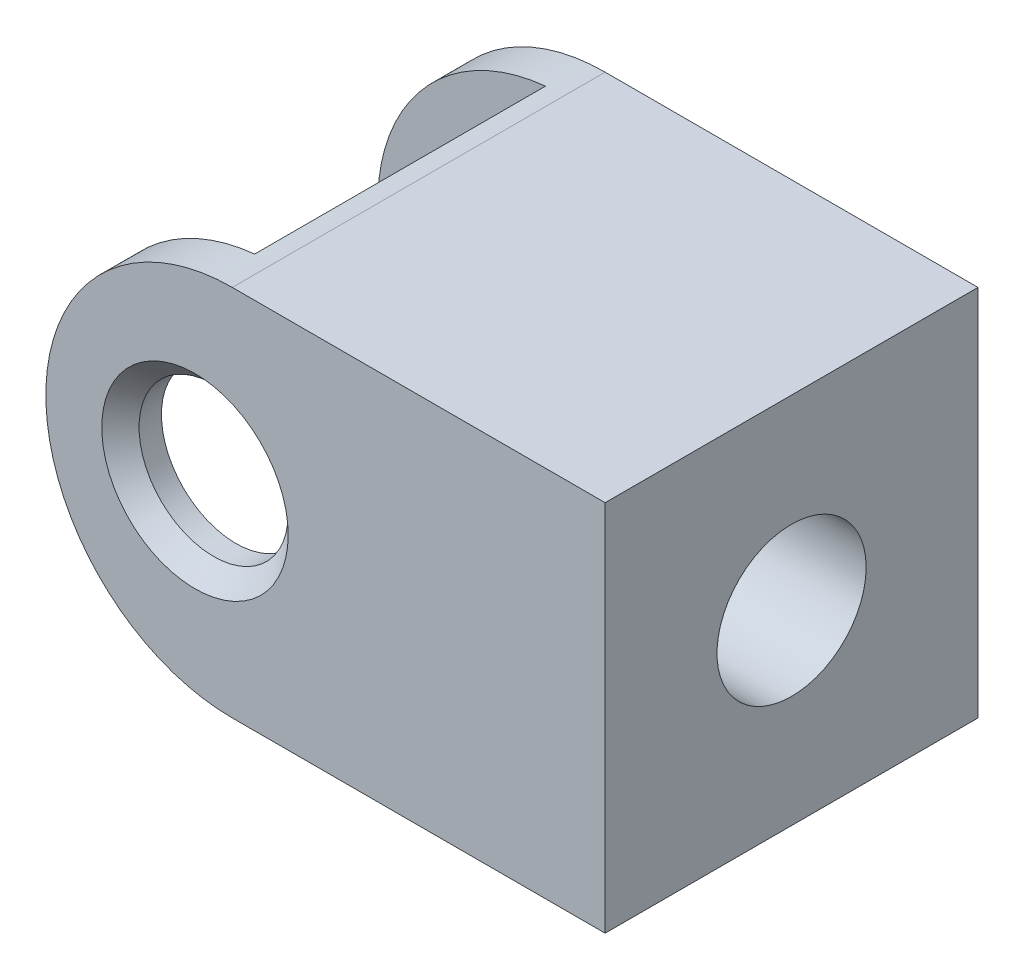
ISO-10303-21;
HEADER;
FILE_DESCRIPTION(('STEP AP214'),'2;1');
FILE_NAME('part.step','',(''),(''),'','','');
FILE_SCHEMA(('AUTOMOTIVE_DESIGN { 1 0 10303 214 1 1 1 1 }'));
ENDSEC;
DATA;
#1=APPLICATION_CONTEXT('core data for automotive mechanical design processes');
#2=APPLICATION_PROTOCOL_DEFINITION('international standard','automotive_design',2000,#1);
#3=PRODUCT_CONTEXT('',#1,'mechanical');
#4=PRODUCT('Part','Part','',(#3));
#5=PRODUCT_RELATED_PRODUCT_CATEGORY('part','',(#4));
#6=PRODUCT_DEFINITION_FORMATION('','',#4);
#7=PRODUCT_DEFINITION_CONTEXT('part definition',#1,'design');
#8=PRODUCT_DEFINITION('design','',#6,#7);
#9=PRODUCT_DEFINITION_SHAPE('','',#8);
#10=(LENGTH_UNIT() NAMED_UNIT(*) SI_UNIT(.MILLI.,.METRE.));
#11=(NAMED_UNIT(*) PLANE_ANGLE_UNIT() SI_UNIT($,.RADIAN.));
#12=(NAMED_UNIT(*) SI_UNIT($,.STERADIAN.) SOLID_ANGLE_UNIT());
#13=UNCERTAINTY_MEASURE_WITH_UNIT(LENGTH_MEASURE(1.E-05),#10,'distance_accuracy_value','');
#14=(GEOMETRIC_REPRESENTATION_CONTEXT(3) GLOBAL_UNCERTAINTY_ASSIGNED_CONTEXT((#13)) GLOBAL_UNIT_ASSIGNED_CONTEXT((#10,
#11,#12)) REPRESENTATION_CONTEXT('',''));
#15=CARTESIAN_POINT('',(0.,0.,0.));
#16=DIRECTION('',(0.,0.,1.));
#17=DIRECTION('',(1.,0.,0.));
#18=AXIS2_PLACEMENT_3D('',#15,#16,#17);
#19=CARTESIAN_POINT('',(0.,0.,20.));
#20=DIRECTION('',(0.,0.,-1.));
#21=DIRECTION('',(-1.,0.,0.));
#22=AXIS2_PLACEMENT_3D('',#19,#20,#21);
#23=CYLINDRICAL_SURFACE('',#22,10.);
#24=DIRECTION('',(0.,0.,-1.));
#25=VECTOR('',#24,1.);
#26=CARTESIAN_POINT('',(-0.999999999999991,9.9498743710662,10.));
#27=LINE('',#26,#25);
#28=CARTESIAN_POINT('',(-0.999999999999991,9.9498743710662,17.8));
#29=VERTEX_POINT('',#28);
#30=CARTESIAN_POINT('',(-0.999999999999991,9.9498743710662,2.2));
#31=VERTEX_POINT('',#30);
#32=EDGE_CURVE('E117',#29,#31,#27,.T.);
#33=ORIENTED_EDGE('',*,*,#32,.F.);
#34=CARTESIAN_POINT('',(0.,0.,17.8));
#35=DIRECTION('',(0.,0.,1.));
#36=DIRECTION('',(1.,0.,0.));
#37=AXIS2_PLACEMENT_3D('',#34,#35,#36);
#38=CIRCLE('',#37,10.);
#39=CARTESIAN_POINT('',(-0.999999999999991,-9.9498743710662,17.8));
#40=VERTEX_POINT('',#39);
#41=EDGE_CURVE('E123',#29,#40,#38,.T.);
#42=ORIENTED_EDGE('',*,*,#41,.T.);
#43=DIRECTION('',(0.,0.,-1.));
#44=VECTOR('',#43,1.);
#45=CARTESIAN_POINT('',(-0.999999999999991,-9.9498743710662,10.));
#46=LINE('',#45,#44);
#47=CARTESIAN_POINT('',(-0.999999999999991,-9.9498743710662,2.2));
#48=VERTEX_POINT('',#47);
#49=EDGE_CURVE('E110',#48,#40,#46,.F.);
#50=ORIENTED_EDGE('',*,*,#49,.F.);
#51=CARTESIAN_POINT('',(0.,0.,2.2));
#52=DIRECTION('',(0.,0.,1.));
#53=DIRECTION('',(1.,0.,0.));
#54=AXIS2_PLACEMENT_3D('',#51,#52,#53);
#55=CIRCLE('',#54,10.);
#56=EDGE_CURVE('E105',#31,#48,#55,.T.);
#57=ORIENTED_EDGE('',*,*,#56,.F.);
#58=EDGE_LOOP('',(#33,#42,#50,#57));
#59=FACE_BOUND('',#58,.T.);
#60=CARTESIAN_POINT('',(0.,0.,0.));
#61=DIRECTION('',(0.,0.,1.));
#62=DIRECTION('',(1.,0.,0.));
#63=AXIS2_PLACEMENT_3D('',#60,#61,#62);
#64=CIRCLE('',#63,10.);
#65=CARTESIAN_POINT('',(0.,10.,0.));
#66=VERTEX_POINT('',#65);
#67=CARTESIAN_POINT('',(0.,-10.,0.));
#68=VERTEX_POINT('',#67);
#69=EDGE_CURVE('E211',#66,#68,#64,.T.);
#70=ORIENTED_EDGE('',*,*,#69,.T.);
#71=DIRECTION('',(0.,0.,-1.));
#72=VECTOR('',#71,1.);
#73=CARTESIAN_POINT('',(0.,-10.,20.));
#74=LINE('',#73,#72);
#75=CARTESIAN_POINT('',(0.,-10.,20.));
#76=VERTEX_POINT('',#75);
#77=EDGE_CURVE('E111',#76,#68,#74,.T.);
#78=ORIENTED_EDGE('',*,*,#77,.F.);
#79=CARTESIAN_POINT('',(0.,0.,20.));
#80=DIRECTION('',(0.,0.,1.));
#81=DIRECTION('',(1.,0.,0.));
#82=AXIS2_PLACEMENT_3D('',#79,#80,#81);
#83=CIRCLE('',#82,10.);
#84=CARTESIAN_POINT('',(0.,10.,20.));
#85=VERTEX_POINT('',#84);
#86=EDGE_CURVE('E212',#85,#76,#83,.T.);
#87=ORIENTED_EDGE('',*,*,#86,.F.);
#88=DIRECTION('',(0.,0.,-1.));
#89=VECTOR('',#88,1.);
#90=CARTESIAN_POINT('',(0.,10.,20.));
#91=LINE('',#90,#89);
#92=EDGE_CURVE('E218',#85,#66,#91,.T.);
#93=ORIENTED_EDGE('',*,*,#92,.T.);
#94=EDGE_LOOP('',(#70,#78,#87,#93));
#95=FACE_BOUND('',#94,.T.);
#96=ADVANCED_FACE('F43',(#59,#95),#23,.T.);
#97=CARTESIAN_POINT('',(20.,-10.,20.));
#98=DIRECTION('',(0.,1.,0.));
#99=DIRECTION('',(0.,0.,1.));
#100=AXIS2_PLACEMENT_3D('',#97,#98,#99);
#101=PLANE('',#100);
#102=DIRECTION('',(1.,0.,0.));
#103=VECTOR('',#102,1.);
#104=CARTESIAN_POINT('',(20.,-10.,0.));
#105=LINE('',#104,#103);
#106=CARTESIAN_POINT('',(20.,-10.,0.));
#107=VERTEX_POINT('',#106);
#108=EDGE_CURVE('E221',#68,#107,#105,.T.);
#109=ORIENTED_EDGE('',*,*,#108,.T.);
#110=DIRECTION('',(0.,0.,-1.));
#111=VECTOR('',#110,1.);
#112=CARTESIAN_POINT('',(20.,-10.,20.));
#113=LINE('',#112,#111);
#114=CARTESIAN_POINT('',(20.,-10.,20.));
#115=VERTEX_POINT('',#114);
#116=EDGE_CURVE('E229',#115,#107,#113,.T.);
#117=ORIENTED_EDGE('',*,*,#116,.F.);
#118=DIRECTION('',(1.,0.,0.));
#119=VECTOR('',#118,1.);
#120=CARTESIAN_POINT('',(20.,-10.,20.));
#121=LINE('',#120,#119);
#122=EDGE_CURVE('E96',#76,#115,#121,.T.);
#123=ORIENTED_EDGE('',*,*,#122,.F.);
#124=ORIENTED_EDGE('',*,*,#77,.T.);
#125=EDGE_LOOP('',(#109,#117,#123,#124));
#126=FACE_BOUND('',#125,.T.);
#127=ADVANCED_FACE('F154',(#126),#101,.F.);
#128=CARTESIAN_POINT('',(20.,10.,20.));
#129=DIRECTION('',(-1.,0.,0.));
#130=DIRECTION('',(0.,0.,1.));
#131=AXIS2_PLACEMENT_3D('',#128,#129,#130);
#132=PLANE('',#131);
#133=CARTESIAN_POINT('',(20.,0.,10.));
#134=DIRECTION('',(1.,0.,0.));
#135=DIRECTION('',(0.,0.,-1.));
#136=AXIS2_PLACEMENT_3D('',#133,#134,#135);
#137=CIRCLE('',#136,4.);
#138=CARTESIAN_POINT('',(20.,0.,6.));
#139=VERTEX_POINT('',#138);
#140=EDGE_CURVE('E203',#139,#139,#137,.T.);
#141=ORIENTED_EDGE('',*,*,#140,.F.);
#142=EDGE_LOOP('',(#141));
#143=FACE_BOUND('',#142,.T.);
#144=DIRECTION('',(0.,1.,0.));
#145=VECTOR('',#144,1.);
#146=CARTESIAN_POINT('',(20.,10.,0.));
#147=LINE('',#146,#145);
#148=CARTESIAN_POINT('',(20.,10.,0.));
#149=VERTEX_POINT('',#148);
#150=EDGE_CURVE('E223',#107,#149,#147,.T.);
#151=ORIENTED_EDGE('',*,*,#150,.T.);
#152=DIRECTION('',(0.,0.,-1.));
#153=VECTOR('',#152,1.);
#154=CARTESIAN_POINT('',(20.,10.,20.));
#155=LINE('',#154,#153);
#156=CARTESIAN_POINT('',(20.,10.,20.));
#157=VERTEX_POINT('',#156);
#158=EDGE_CURVE('E227',#157,#149,#155,.T.);
#159=ORIENTED_EDGE('',*,*,#158,.F.);
#160=DIRECTION('',(0.,1.,0.));
#161=VECTOR('',#160,1.);
#162=CARTESIAN_POINT('',(20.,10.,20.));
#163=LINE('',#162,#161);
#164=EDGE_CURVE('E215',#115,#157,#163,.T.);
#165=ORIENTED_EDGE('',*,*,#164,.F.);
#166=ORIENTED_EDGE('',*,*,#116,.T.);
#167=EDGE_LOOP('',(#151,#159,#165,#166));
#168=FACE_BOUND('',#167,.T.);
#169=ADVANCED_FACE('F159',(#143,#168),#132,.F.);
#170=CARTESIAN_POINT('',(0.,10.,20.));
#171=DIRECTION('',(0.,-1.,0.));
#172=DIRECTION('',(0.,0.,-1.));
#173=AXIS2_PLACEMENT_3D('',#170,#171,#172);
#174=PLANE('',#173);
#175=DIRECTION('',(-1.,0.,0.));
#176=VECTOR('',#175,1.);
#177=CARTESIAN_POINT('',(0.,10.,0.));
#178=LINE('',#177,#176);
#179=EDGE_CURVE('E88',#149,#66,#178,.T.);
#180=ORIENTED_EDGE('',*,*,#179,.T.);
#181=ORIENTED_EDGE('',*,*,#92,.F.);
#182=DIRECTION('',(-1.,0.,0.));
#183=VECTOR('',#182,1.);
#184=CARTESIAN_POINT('',(0.,10.,20.));
#185=LINE('',#184,#183);
#186=EDGE_CURVE('E67',#157,#85,#185,.T.);
#187=ORIENTED_EDGE('',*,*,#186,.F.);
#188=ORIENTED_EDGE('',*,*,#158,.T.);
#189=EDGE_LOOP('',(#180,#181,#187,#188));
#190=FACE_BOUND('',#189,.T.);
#191=ADVANCED_FACE('F169',(#190),#174,.F.);
#192=CARTESIAN_POINT('',(0.,0.,20.));
#193=DIRECTION('',(0.,0.,1.));
#194=DIRECTION('',(1.,0.,0.));
#195=AXIS2_PLACEMENT_3D('',#192,#193,#194);
#196=PLANE('',#195);
#197=CARTESIAN_POINT('',(-2.,0.,20.));
#198=DIRECTION('',(0.,0.,1.));
#199=DIRECTION('',(1.,0.,0.));
#200=AXIS2_PLACEMENT_3D('',#197,#198,#199);
#201=CIRCLE('',#200,5.);
#202=CARTESIAN_POINT('',(3.,0.,20.));
#203=VERTEX_POINT('',#202);
#204=EDGE_CURVE('E136',#203,#203,#201,.F.);
#205=ORIENTED_EDGE('',*,*,#204,.T.);
#206=EDGE_LOOP('',(#205));
#207=FACE_BOUND('',#206,.T.);
#208=ORIENTED_EDGE('',*,*,#86,.T.);
#209=ORIENTED_EDGE('',*,*,#122,.T.);
#210=ORIENTED_EDGE('',*,*,#164,.T.);
#211=ORIENTED_EDGE('',*,*,#186,.T.);
#212=EDGE_LOOP('',(#208,#209,#210,#211));
#213=FACE_BOUND('',#212,.T.);
#214=ADVANCED_FACE('F173',(#207,#213),#196,.T.);
#215=CARTESIAN_POINT('',(0.,0.,0.));
#216=DIRECTION('',(0.,0.,1.));
#217=DIRECTION('',(1.,0.,0.));
#218=AXIS2_PLACEMENT_3D('',#215,#216,#217);
#219=PLANE('',#218);
#220=CARTESIAN_POINT('',(-2.,0.,0.));
#221=DIRECTION('',(0.,0.,1.));
#222=DIRECTION('',(1.,0.,0.));
#223=AXIS2_PLACEMENT_3D('',#220,#221,#222);
#224=CIRCLE('',#223,5.);
#225=CARTESIAN_POINT('',(3.,0.,0.));
#226=VERTEX_POINT('',#225);
#227=EDGE_CURVE('E52',#226,#226,#224,.T.);
#228=ORIENTED_EDGE('',*,*,#227,.T.);
#229=EDGE_LOOP('',(#228));
#230=FACE_BOUND('',#229,.T.);
#231=ORIENTED_EDGE('',*,*,#69,.F.);
#232=ORIENTED_EDGE('',*,*,#179,.F.);
#233=ORIENTED_EDGE('',*,*,#150,.F.);
#234=ORIENTED_EDGE('',*,*,#108,.F.);
#235=EDGE_LOOP('',(#231,#232,#233,#234));
#236=FACE_BOUND('',#235,.T.);
#237=ADVANCED_FACE('F141',(#230,#236),#219,.F.);
#238=CARTESIAN_POINT('',(-2.,0.,17.8));
#239=DIRECTION('',(0.,0.,-1.));
#240=DIRECTION('',(-1.,0.,0.));
#241=AXIS2_PLACEMENT_3D('',#238,#239,#240);
#242=CYLINDRICAL_SURFACE('',#241,10.);
#243=ORIENTED_EDGE('',*,*,#32,.T.);
#244=CARTESIAN_POINT('',(-2.,0.,2.2));
#245=DIRECTION('',(0.,0.,1.));
#246=DIRECTION('',(1.,0.,0.));
#247=AXIS2_PLACEMENT_3D('',#244,#245,#246);
#248=CIRCLE('',#247,10.);
#249=EDGE_CURVE('E58',#48,#31,#248,.T.);
#250=ORIENTED_EDGE('',*,*,#249,.F.);
#251=ORIENTED_EDGE('',*,*,#49,.T.);
#252=CARTESIAN_POINT('',(-2.,0.,17.8));
#253=DIRECTION('',(0.,0.,1.));
#254=DIRECTION('',(1.,0.,0.));
#255=AXIS2_PLACEMENT_3D('',#252,#253,#254);
#256=CIRCLE('',#255,10.);
#257=EDGE_CURVE('E118',#40,#29,#256,.T.);
#258=ORIENTED_EDGE('',*,*,#257,.T.);
#259=EDGE_LOOP('',(#243,#250,#251,#258));
#260=FACE_BOUND('',#259,.T.);
#261=ADVANCED_FACE('F114',(#260),#242,.F.);
#262=CARTESIAN_POINT('',(-2.,0.,17.8));
#263=DIRECTION('',(0.,0.,1.));
#264=DIRECTION('',(1.,0.,0.));
#265=AXIS2_PLACEMENT_3D('',#262,#263,#264);
#266=PLANE('',#265);
#267=CARTESIAN_POINT('',(-2.,0.,17.8));
#268=DIRECTION('',(0.,0.,1.));
#269=DIRECTION('',(1.,0.,0.));
#270=AXIS2_PLACEMENT_3D('',#267,#268,#269);
#271=CIRCLE('',#270,4.);
#272=CARTESIAN_POINT('',(2.,0.,17.8));
#273=VERTEX_POINT('',#272);
#274=EDGE_CURVE('E119',#273,#273,#271,.T.);
#275=ORIENTED_EDGE('',*,*,#274,.T.);
#276=EDGE_LOOP('',(#275));
#277=FACE_BOUND('',#276,.T.);
#278=ORIENTED_EDGE('',*,*,#257,.F.);
#279=ORIENTED_EDGE('',*,*,#41,.F.);
#280=EDGE_LOOP('',(#278,#279));
#281=FACE_BOUND('',#280,.T.);
#282=ADVANCED_FACE('F181',(#277,#281),#266,.F.);
#283=CARTESIAN_POINT('',(-2.,0.,2.2));
#284=DIRECTION('',(0.,0.,1.));
#285=DIRECTION('',(1.,0.,0.));
#286=AXIS2_PLACEMENT_3D('',#283,#284,#285);
#287=PLANE('',#286);
#288=CARTESIAN_POINT('',(-2.,0.,2.2));
#289=DIRECTION('',(0.,0.,1.));
#290=DIRECTION('',(1.,0.,0.));
#291=AXIS2_PLACEMENT_3D('',#288,#289,#290);
#292=CIRCLE('',#291,4.);
#293=CARTESIAN_POINT('',(2.,0.,2.2));
#294=VERTEX_POINT('',#293);
#295=EDGE_CURVE('E130',#294,#294,#292,.T.);
#296=ORIENTED_EDGE('',*,*,#295,.F.);
#297=EDGE_LOOP('',(#296));
#298=FACE_BOUND('',#297,.T.);
#299=ORIENTED_EDGE('',*,*,#56,.T.);
#300=ORIENTED_EDGE('',*,*,#249,.T.);
#301=EDGE_LOOP('',(#299,#300));
#302=FACE_BOUND('',#301,.T.);
#303=ADVANCED_FACE('F106',(#298,#302),#287,.T.);
#304=CARTESIAN_POINT('',(-2.,0.,-15.8));
#305=DIRECTION('',(0.,0.,1.));
#306=DIRECTION('',(1.,0.,0.));
#307=AXIS2_PLACEMENT_3D('',#304,#305,#306);
#308=CYLINDRICAL_SURFACE('',#307,4.);
#309=CARTESIAN_POINT('',(-2.,0.,1.));
#310=DIRECTION('',(0.,0.,1.));
#311=DIRECTION('',(1.,0.,0.));
#312=AXIS2_PLACEMENT_3D('',#309,#310,#311);
#313=CIRCLE('',#312,4.);
#314=CARTESIAN_POINT('',(2.,0.,1.));
#315=VERTEX_POINT('',#314);
#316=EDGE_CURVE('E11',#315,#315,#313,.F.);
#317=ORIENTED_EDGE('',*,*,#316,.T.);
#318=EDGE_LOOP('',(#317));
#319=FACE_BOUND('',#318,.T.);
#320=ORIENTED_EDGE('',*,*,#295,.T.);
#321=EDGE_LOOP('',(#320));
#322=FACE_BOUND('',#321,.T.);
#323=ADVANCED_FACE('F187',(#319,#322),#308,.F.);
#324=CARTESIAN_POINT('',(-2.,0.,19.));
#325=DIRECTION('',(0.,0.,1.));
#326=DIRECTION('',(1.,0.,0.));
#327=AXIS2_PLACEMENT_3D('',#324,#325,#326);
#328=CIRCLE('',#327,4.);
#329=CARTESIAN_POINT('',(2.,0.,19.));
#330=VERTEX_POINT('',#329);
#331=EDGE_CURVE('E129',#330,#330,#328,.T.);
#332=ORIENTED_EDGE('',*,*,#331,.T.);
#333=EDGE_LOOP('',(#332));
#334=FACE_BOUND('',#333,.T.);
#335=ORIENTED_EDGE('',*,*,#274,.F.);
#336=EDGE_LOOP('',(#335));
#337=FACE_BOUND('',#336,.T.);
#338=ADVANCED_FACE('F191',(#334,#337),#308,.F.);
#339=CARTESIAN_POINT('',(12.,0.,10.));
#340=DIRECTION('',(1.,0.,0.));
#341=DIRECTION('',(0.,0.,-1.));
#342=AXIS2_PLACEMENT_3D('',#339,#340,#341);
#343=CYLINDRICAL_SURFACE('',#342,4.);
#344=CARTESIAN_POINT('',(12.,0.,10.));
#345=DIRECTION('',(1.,0.,0.));
#346=DIRECTION('',(0.,0.,-1.));
#347=AXIS2_PLACEMENT_3D('',#344,#345,#346);
#348=CIRCLE('',#347,4.);
#349=CARTESIAN_POINT('',(12.,0.,6.));
#350=VERTEX_POINT('',#349);
#351=EDGE_CURVE('E133',#350,#350,#348,.T.);
#352=ORIENTED_EDGE('',*,*,#351,.F.);
#353=EDGE_LOOP('',(#352));
#354=FACE_BOUND('',#353,.T.);
#355=ORIENTED_EDGE('',*,*,#140,.T.);
#356=EDGE_LOOP('',(#355));
#357=FACE_BOUND('',#356,.T.);
#358=ADVANCED_FACE('F193',(#354,#357),#343,.F.);
#359=CARTESIAN_POINT('',(12.,0.,10.));
#360=DIRECTION('',(1.,0.,0.));
#361=DIRECTION('',(0.,0.,-1.));
#362=AXIS2_PLACEMENT_3D('',#359,#360,#361);
#363=PLANE('',#362);
#364=ORIENTED_EDGE('',*,*,#351,.T.);
#365=EDGE_LOOP('',(#364));
#366=FACE_BOUND('',#365,.T.);
#367=ADVANCED_FACE('F150',(#366),#363,.T.);
#368=CARTESIAN_POINT('',(-2.,0.,19.));
#369=DIRECTION('',(0.,0.,1.));
#370=DIRECTION('',(1.,0.,0.));
#371=AXIS2_PLACEMENT_3D('',#368,#369,#370);
#372=CONICAL_SURFACE('',#371,4.,0.78539816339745);
#373=ORIENTED_EDGE('',*,*,#204,.F.);
#374=EDGE_LOOP('',(#373));
#375=FACE_BOUND('',#374,.T.);
#376=ORIENTED_EDGE('',*,*,#331,.F.);
#377=EDGE_LOOP('',(#376));
#378=FACE_BOUND('',#377,.T.);
#379=ADVANCED_FACE('F145',(#375,#378),#372,.F.);
#380=CARTESIAN_POINT('',(-2.,0.,0.));
#381=DIRECTION('',(0.,0.,-1.));
#382=DIRECTION('',(-1.,0.,0.));
#383=AXIS2_PLACEMENT_3D('',#380,#381,#382);
#384=CONICAL_SURFACE('',#383,5.,0.785398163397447);
#385=ORIENTED_EDGE('',*,*,#316,.F.);
#386=EDGE_LOOP('',(#385));
#387=FACE_BOUND('',#386,.T.);
#388=ORIENTED_EDGE('',*,*,#227,.F.);
#389=EDGE_LOOP('',(#388));
#390=FACE_BOUND('',#389,.T.);
#391=ADVANCED_FACE('F46',(#387,#390),#384,.F.);
#392=CLOSED_SHELL('',(#96,#127,#169,#191,#214,#237,#261,#282,#303,#323,#338,#358,#367,#379,#391));
#393=MANIFOLD_SOLID_BREP('B2',#392);
#394=ADVANCED_BREP_SHAPE_REPRESENTATION('',(#18,#393),#14);
#395=SHAPE_DEFINITION_REPRESENTATION(#9,#394);
ENDSEC;
END-ISO-10303-21;
